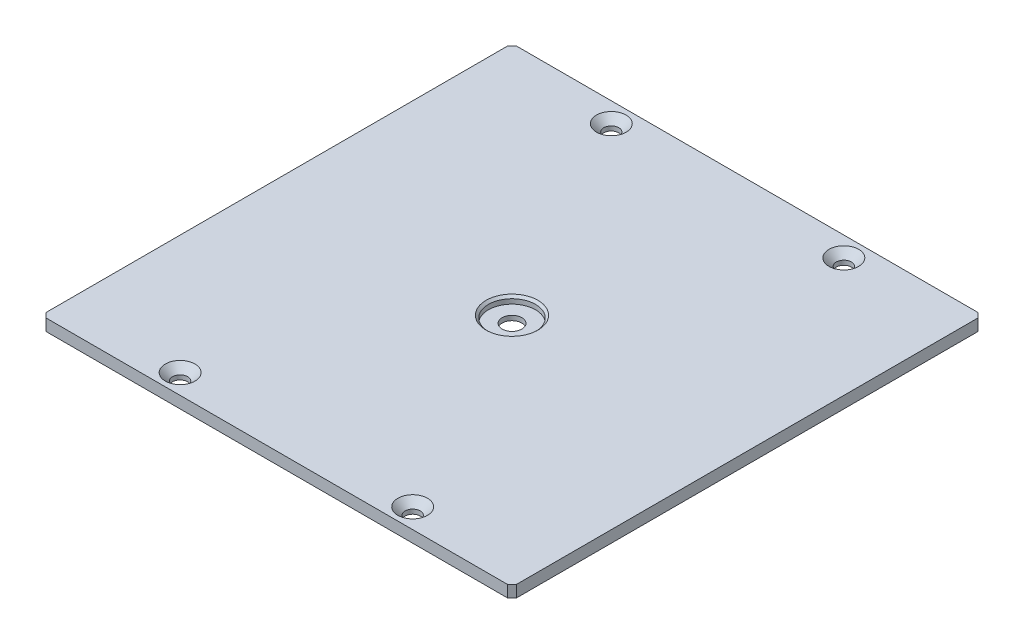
from build123d import *

# Parameters (mm, degrees)
SKETCH1_W                                           = 100
SKETCH1_H                                           = 100
BOSS_EXTRUDE1_DEPTH                                 = 2.5
SKETCH2_W                                           = 2
SKETCH2_H                                           = 34
BOSS_EXTRUDE2_DEPTH                                 = 2
F_4_2_4_2_DIAMETER_HOLE1_D                          = 4.2
CIRPATTERN1_COUNT                                   = 4
CHAMFER1_SIZE                                       = 1
CSK_FOR_M3_COUNTERSUNK_FLAT_HEAD_SCREW1_D           = 3.2
CSK_FOR_M3_COUNTERSUNK_FLAT_HEAD_SCREW1_CSINK_D     = 6.3
CSK_FOR_M3_COUNTERSUNK_FLAT_HEAD_SCREW1_CSINK_ANGLE = 90
F_10_0_10_DIAMETER_HOLE1_D                          = 10
F_10_0_10_DIAMETER_HOLE1_DEPTH                      = 1.5
CHAMFER2_SIZE                                       = 0.5


with BuildPart() as part:
    # Sketch1 → Boss-Extrude1 (new body)
    with BuildSketch(Plane(origin=(0, 0, 0), x_dir=(1, 0, 0), z_dir=(0, 1, 0))):
        Rectangle(SKETCH1_W, SKETCH1_H)
    extrude(amount=BOSS_EXTRUDE1_DEPTH)

    # Sketch2 → Boss-Extrude2 (add)
    with BuildSketch(Plane.XZ):
        with Locations((-46.4, 0)):
            Rectangle(SKETCH2_W, SKETCH2_H)
    boss_extrude2 = extrude(amount=BOSS_EXTRUDE2_DEPTH)

    # 4.2 _4.2_ Diameter Hole1 (through all)
    with Locations(Plane(origin=(0, 2.5, 0), x_dir=(1, 0, 0), z_dir=(0, 1, 0))):
        with Locations((0, 0)):
            Hole(F_4_2_4_2_DIAMETER_HOLE1_D / 2)

    # CirPattern1: Boss-Extrude2 ×4 about axis
    cirpattern1_axis = Axis((0, 0, 0), (0, 1, 0))
    for i in range(1, CIRPATTERN1_COUNT):
        add(boss_extrude2.rotate(cirpattern1_axis, i * 360 / CIRPATTERN1_COUNT))

    # Chamfer1
    chamfer1_edges = [part.edges().sort_by_distance(p)[0] for p in [
        (-50, 1.25, -50),
        (50, 1.25, -50),
        (50, 1.25, 50),
        (-50, 1.25, 50),
    ]]
    chamfer(chamfer1_edges, length=CHAMFER1_SIZE)

    # CSK for M3 Countersunk Flat Head Screw1 (through all)
    with Locations(Plane(origin=(0, 2.5, 0), x_dir=(1, 0, 0), z_dir=(0, 1, 0))):
        with Locations((-24.7, 45.8), (24.7, 45.8), (-24.7, -45.8), (24.7, -45.8)):
            CounterSinkHole(CSK_FOR_M3_COUNTERSUNK_FLAT_HEAD_SCREW1_D / 2, CSK_FOR_M3_COUNTERSUNK_FLAT_HEAD_SCREW1_CSINK_D / 2, counter_sink_angle=CSK_FOR_M3_COUNTERSUNK_FLAT_HEAD_SCREW1_CSINK_ANGLE)

    # 10.0 _10_ Diameter Hole1
    with Locations(Plane(origin=(0, 2.5, 0), x_dir=(1, 0, 0), z_dir=(0, 1, 0))):
        with Locations((0, 0)):
            Hole(F_10_0_10_DIAMETER_HOLE1_D / 2, depth=F_10_0_10_DIAMETER_HOLE1_DEPTH)

    # Chamfer2
    chamfer2_edges = [part.edges().sort_by_distance(p)[0] for p in [
        (5, 2.5, 0),
    ]]
    chamfer(chamfer2_edges, length=CHAMFER2_SIZE)


solid = part.part
